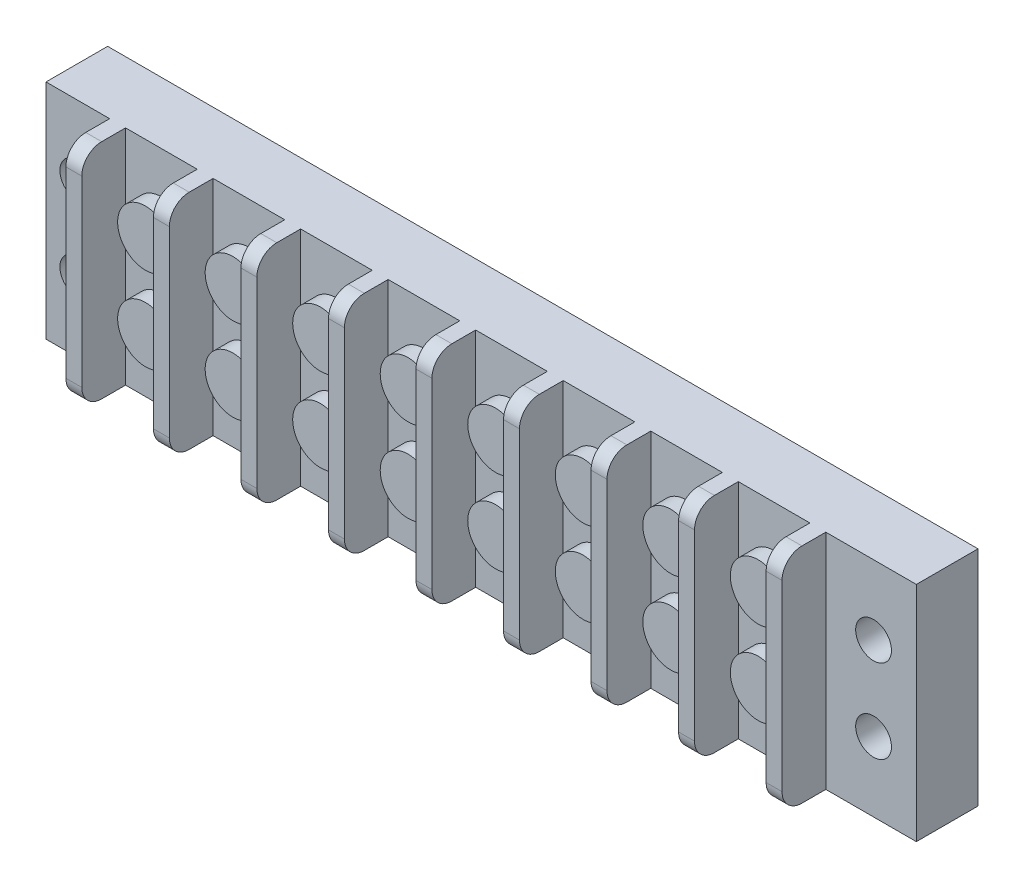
from build123d import *

# Parameters (mm, degrees)
SKETCH1_W              = 111.125
SKETCH1_H              = 28.448
BASE_EXTRUDE_DEPTH     = 7.874
SKETCH2_R              = 2.286
CUT_EXTRUDE1_DEPTH     = 115.978494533
SKETCH3_W              = 2.032
SKETCH3_H              = 28.448
BOSS_EXTRUDE1_DEPTH    = 5.588
FILLET3_R              = 2.54
LPATTERN1_COUNT        = 9
LPATTERN1_PITCH        = 11.176
FILLET3_OF_LPATTERN1_R = 2.54
SKETCH6_R              = 3.556
BOSS_EXTRUDE2_DEPTH    = 2.032
LPATTERN2_COUNT        = 8
LPATTERN2_PITCH        = 11.176


with BuildPart() as part:
    # Sketch1 → Base-Extrude (new body)
    with BuildSketch(Plane.XY):
        with Locations((55.5625, 14.224)):
            Rectangle(SKETCH1_W, SKETCH1_H)
    extrude(amount=BASE_EXTRUDE_DEPTH)

    # Sketch2 → Cut-Extrude1 (cut, through all)
    with BuildSketch(Plane.XY.offset(7.874)):
        with Locations((4.064, 19.558)):
            Circle(SKETCH2_R)
        with Locations((105.664, 19.558)):
            Circle(SKETCH2_R)
        with Locations((105.664, 8.89)):
            Circle(SKETCH2_R)
        with Locations((4.064, 8.89)):
            Circle(SKETCH2_R)
    extrude(amount=-CUT_EXTRUDE1_DEPTH, mode=Mode.SUBTRACT)

    # Sketch3 → Boss-Extrude1 (add)
    with BuildSketch(Plane.XY.offset(7.874)):
        with Locations((9.144, 14.224)):
            Rectangle(SKETCH3_W, SKETCH3_H)
    boss_extrude1 = extrude(amount=BOSS_EXTRUDE1_DEPTH)

    # Fillet3
    fillet3_edges = [part.edges().sort_by_distance(p)[0] for p in [
        (9.144, 0, 13.462),
        (9.144, 28.448, 13.462),
    ]]
    fillet(fillet3_edges, radius=FILLET3_R)

    # LPattern1: Boss-Extrude1 ×9
    with Locations(*[(i * LPATTERN1_PITCH, 0, 0) for i in range(1, LPATTERN1_COUNT)]):
        add(boss_extrude1)

    # Fillet3 of LPattern1
    fillet3_of_lpattern1_edges = [part.edges().sort_by_distance(p)[0] for p in [
        (20.32, 0, 13.462),
        (20.32, 28.448, 13.462),
        (31.496, 0, 13.462),
        (31.496, 28.448, 13.462),
        (42.672, 0, 13.462),
        (42.672, 28.448, 13.462),
        (53.848, 0, 13.462),
        (53.848, 28.448, 13.462),
        (65.024, 0, 13.462),
        (65.024, 28.448, 13.462),
        (76.2, 0, 13.462),
        (76.2, 28.448, 13.462),
        (87.376, 0, 13.462),
        (87.376, 28.448, 13.462),
        (98.552, 0, 13.462),
        (98.552, 28.448, 13.462),
    ]]
    fillet(fillet3_of_lpattern1_edges, radius=FILLET3_OF_LPATTERN1_R)

    # Sketch6 → Boss-Extrude2 (add)
    with BuildSketch(Plane.XY.offset(7.874)):
        with Locations(Location((14.732, 19.558, 0), (0, 0, 180))):
            Circle(SKETCH6_R)
        with Locations(Location((14.732, 8.89, 0), (0, 0, 180))):
            Circle(SKETCH6_R)
    boss_extrude2 = extrude(amount=BOSS_EXTRUDE2_DEPTH)

    # LPattern2: Boss-Extrude2 ×8
    with Locations(*[(i * LPATTERN2_PITCH, 0, 0) for i in range(1, LPATTERN2_COUNT)]):
        add(boss_extrude2)


solid = part.part
